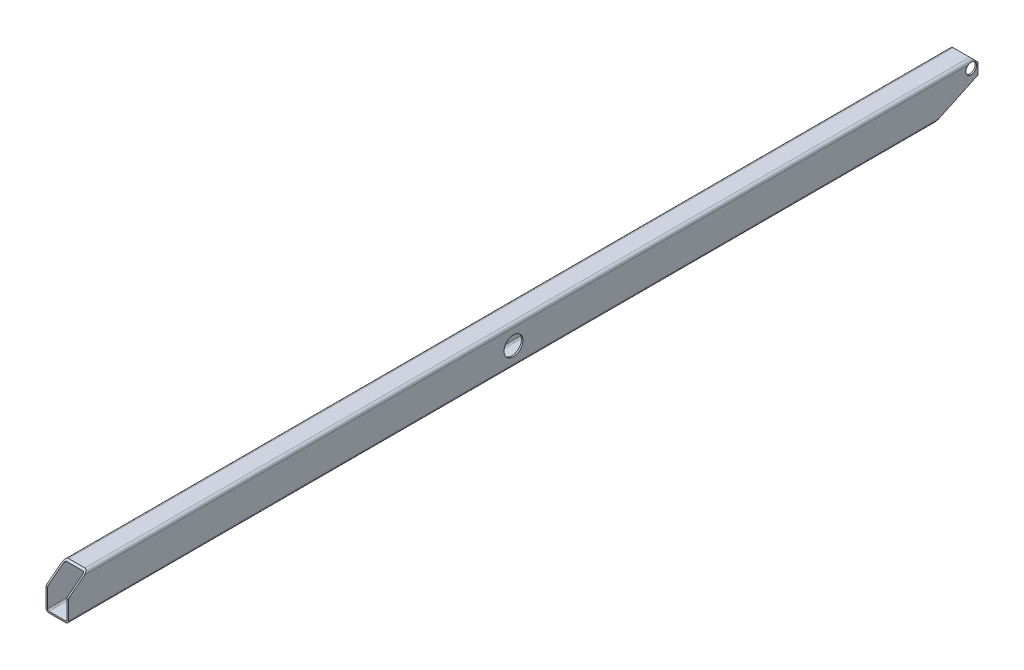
ISO-10303-21;
HEADER;
FILE_DESCRIPTION(('STEP AP214'),'2;1');
FILE_NAME('part.step','',(''),(''),'','','');
FILE_SCHEMA(('AUTOMOTIVE_DESIGN { 1 0 10303 214 1 1 1 1 }'));
ENDSEC;
DATA;
#1=APPLICATION_CONTEXT('core data for automotive mechanical design processes');
#2=APPLICATION_PROTOCOL_DEFINITION('international standard','automotive_design',2000,#1);
#3=PRODUCT_CONTEXT('',#1,'mechanical');
#4=PRODUCT('Part','Part','',(#3));
#5=PRODUCT_RELATED_PRODUCT_CATEGORY('part','',(#4));
#6=PRODUCT_DEFINITION_FORMATION('','',#4);
#7=PRODUCT_DEFINITION_CONTEXT('part definition',#1,'design');
#8=PRODUCT_DEFINITION('design','',#6,#7);
#9=PRODUCT_DEFINITION_SHAPE('','',#8);
#10=(LENGTH_UNIT() NAMED_UNIT(*) SI_UNIT(.MILLI.,.METRE.));
#11=(NAMED_UNIT(*) PLANE_ANGLE_UNIT() SI_UNIT($,.RADIAN.));
#12=(NAMED_UNIT(*) SI_UNIT($,.STERADIAN.) SOLID_ANGLE_UNIT());
#13=UNCERTAINTY_MEASURE_WITH_UNIT(LENGTH_MEASURE(1.E-05),#10,'distance_accuracy_value','');
#14=(GEOMETRIC_REPRESENTATION_CONTEXT(3) GLOBAL_UNCERTAINTY_ASSIGNED_CONTEXT((#13)) GLOBAL_UNIT_ASSIGNED_CONTEXT((#10,
#11,#12)) REPRESENTATION_CONTEXT('',''));
#15=CARTESIAN_POINT('',(0.,0.,0.));
#16=DIRECTION('',(0.,0.,1.));
#17=DIRECTION('',(1.,0.,0.));
#18=AXIS2_PLACEMENT_3D('',#15,#16,#17);
#19=CARTESIAN_POINT('',(20.0000000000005,20.,-3029.));
#20=DIRECTION('',(0.,0.,1.));
#21=DIRECTION('',(1.,0.,0.));
#22=AXIS2_PLACEMENT_3D('',#19,#20,#21);
#23=PLANE('',#22);
#24=DIRECTION('',(0.,1.,0.));
#25=VECTOR('',#24,1.);
#26=CARTESIAN_POINT('',(150.,20.,-3029.));
#27=LINE('',#26,#25);
#28=CARTESIAN_POINT('',(150.,140.,-3029.));
#29=VERTEX_POINT('',#28);
#30=CARTESIAN_POINT('',(150.,215.,-3029.));
#31=VERTEX_POINT('',#30);
#32=EDGE_CURVE('E244',#29,#31,#27,.T.);
#33=ORIENTED_EDGE('',*,*,#32,.F.);
#34=DIRECTION('',(1.,0.,0.));
#35=VECTOR('',#34,1.);
#36=CARTESIAN_POINT('',(0.,140.,-3029.));
#37=LINE('',#36,#35);
#38=CARTESIAN_POINT('',(140.,140.,-3029.));
#39=VERTEX_POINT('',#38);
#40=EDGE_CURVE('E226',#39,#29,#37,.T.);
#41=ORIENTED_EDGE('',*,*,#40,.F.);
#42=DIRECTION('',(0.,1.,0.));
#43=VECTOR('',#42,1.);
#44=CARTESIAN_POINT('',(140.,20.,-3029.));
#45=LINE('',#44,#43);
#46=CARTESIAN_POINT('',(140.,215.,-3029.));
#47=VERTEX_POINT('',#46);
#48=EDGE_CURVE('E370',#39,#47,#45,.T.);
#49=ORIENTED_EDGE('',*,*,#48,.T.);
#50=DIRECTION('',(1.,0.,0.));
#51=VECTOR('',#50,1.);
#52=CARTESIAN_POINT('',(20.0000000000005,215.,-3029.));
#53=LINE('',#52,#51);
#54=EDGE_CURVE('E284',#47,#31,#53,.T.);
#55=ORIENTED_EDGE('',*,*,#54,.T.);
#56=EDGE_LOOP('',(#33,#41,#49,#55));
#57=FACE_BOUND('',#56,.T.);
#58=ADVANCED_FACE('F32',(#57),#23,.F.);
#59=CARTESIAN_POINT('',(20.0000000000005,20.,3029.));
#60=DIRECTION('',(0.,0.,1.));
#61=DIRECTION('',(1.,0.,0.));
#62=AXIS2_PLACEMENT_3D('',#59,#60,#61);
#63=PLANE('',#62);
#64=DIRECTION('',(0.,-1.,0.));
#65=VECTOR('',#64,1.);
#66=CARTESIAN_POINT('',(10.0000000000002,230.,3029.));
#67=LINE('',#66,#65);
#68=CARTESIAN_POINT('',(10.0000000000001,140.15197005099,3029.));
#69=VERTEX_POINT('',#68);
#70=CARTESIAN_POINT('',(10.,20.,3029.));
#71=VERTEX_POINT('',#70);
#72=EDGE_CURVE('E358',#69,#71,#67,.T.);
#73=ORIENTED_EDGE('',*,*,#72,.F.);
#74=DIRECTION('',(-1.,0.,0.));
#75=VECTOR('',#74,1.);
#76=CARTESIAN_POINT('',(20.0000000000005,140.15197005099,3029.));
#77=LINE('',#76,#75);
#78=CARTESIAN_POINT('',(0.,140.15197005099,3029.));
#79=VERTEX_POINT('',#78);
#80=EDGE_CURVE('E343',#69,#79,#77,.T.);
#81=ORIENTED_EDGE('',*,*,#80,.T.);
#82=DIRECTION('',(0.,-1.,0.));
#83=VECTOR('',#82,1.);
#84=CARTESIAN_POINT('',(0.,230.,3029.));
#85=LINE('',#84,#83);
#86=CARTESIAN_POINT('',(0.,20.,3029.));
#87=VERTEX_POINT('',#86);
#88=EDGE_CURVE('E256',#79,#87,#85,.T.);
#89=ORIENTED_EDGE('',*,*,#88,.T.);
#90=CARTESIAN_POINT('',(20.0000000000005,20.,3029.));
#91=DIRECTION('',(0.,0.,1.));
#92=DIRECTION('',(1.,0.,0.));
#93=AXIS2_PLACEMENT_3D('',#90,#91,#92);
#94=CIRCLE('',#93,20.0000000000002);
#95=CARTESIAN_POINT('',(19.9999999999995,0.,3029.));
#96=VERTEX_POINT('',#95);
#97=EDGE_CURVE('E243',#87,#96,#94,.T.);
#98=ORIENTED_EDGE('',*,*,#97,.T.);
#99=DIRECTION('',(1.,0.,0.));
#100=VECTOR('',#99,1.);
#101=CARTESIAN_POINT('',(19.9999999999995,0.,3029.));
#102=LINE('',#101,#100);
#103=CARTESIAN_POINT('',(129.999999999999,0.,3029.));
#104=VERTEX_POINT('',#103);
#105=EDGE_CURVE('E247',#96,#104,#102,.T.);
#106=ORIENTED_EDGE('',*,*,#105,.T.);
#107=CARTESIAN_POINT('',(130.,20.,3029.));
#108=DIRECTION('',(0.,0.,1.));
#109=DIRECTION('',(1.,0.,0.));
#110=AXIS2_PLACEMENT_3D('',#107,#108,#109);
#111=CIRCLE('',#110,19.9999999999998);
#112=CARTESIAN_POINT('',(150.,20.,3029.));
#113=VERTEX_POINT('',#112);
#114=EDGE_CURVE('E719',#104,#113,#111,.T.);
#115=ORIENTED_EDGE('',*,*,#114,.T.);
#116=DIRECTION('',(0.,1.,0.));
#117=VECTOR('',#116,1.);
#118=CARTESIAN_POINT('',(150.,20.,3029.));
#119=LINE('',#118,#117);
#120=CARTESIAN_POINT('',(150.,140.15197005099,3029.));
#121=VERTEX_POINT('',#120);
#122=EDGE_CURVE('E716',#113,#121,#119,.T.);
#123=ORIENTED_EDGE('',*,*,#122,.T.);
#124=DIRECTION('',(-1.,0.,0.));
#125=VECTOR('',#124,1.);
#126=CARTESIAN_POINT('',(20.0000000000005,140.15197005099,3029.));
#127=LINE('',#126,#125);
#128=CARTESIAN_POINT('',(140.,140.15197005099,3029.));
#129=VERTEX_POINT('',#128);
#130=EDGE_CURVE('E340',#121,#129,#127,.T.);
#131=ORIENTED_EDGE('',*,*,#130,.T.);
#132=DIRECTION('',(0.,1.,0.));
#133=VECTOR('',#132,1.);
#134=CARTESIAN_POINT('',(140.,20.,3029.));
#135=LINE('',#134,#133);
#136=CARTESIAN_POINT('',(140.,20.,3029.));
#137=VERTEX_POINT('',#136);
#138=EDGE_CURVE('E748',#137,#129,#135,.T.);
#139=ORIENTED_EDGE('',*,*,#138,.F.);
#140=CARTESIAN_POINT('',(130.,20.,3029.));
#141=DIRECTION('',(0.,0.,1.));
#142=DIRECTION('',(1.,0.,0.));
#143=AXIS2_PLACEMENT_3D('',#140,#141,#142);
#144=CIRCLE('',#143,9.99999999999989);
#145=CARTESIAN_POINT('',(129.999999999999,10.,3029.));
#146=VERTEX_POINT('',#145);
#147=EDGE_CURVE('E750',#146,#137,#144,.T.);
#148=ORIENTED_EDGE('',*,*,#147,.F.);
#149=DIRECTION('',(1.,0.,0.));
#150=VECTOR('',#149,1.);
#151=CARTESIAN_POINT('',(20.,9.99999999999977,3029.));
#152=LINE('',#151,#150);
#153=CARTESIAN_POINT('',(20.,9.99999999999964,3029.));
#154=VERTEX_POINT('',#153);
#155=EDGE_CURVE('E753',#154,#146,#152,.T.);
#156=ORIENTED_EDGE('',*,*,#155,.F.);
#157=CARTESIAN_POINT('',(20.0000000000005,20.,3029.));
#158=DIRECTION('',(0.,0.,1.));
#159=DIRECTION('',(1.,0.,0.));
#160=AXIS2_PLACEMENT_3D('',#157,#158,#159);
#161=CIRCLE('',#160,10.0000000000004);
#162=EDGE_CURVE('E369',#71,#154,#161,.T.);
#163=ORIENTED_EDGE('',*,*,#162,.F.);
#164=EDGE_LOOP('',(#73,#81,#89,#98,#106,#115,#123,#131,#139,#148,#156,#163));
#165=FACE_BOUND('',#164,.T.);
#166=ADVANCED_FACE('F367',(#165),#63,.T.);
#167=DIRECTION('',(0.,-1.,0.));
#168=VECTOR('',#167,1.);
#169=CARTESIAN_POINT('',(10.0000000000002,230.,-3029.));
#170=LINE('',#169,#168);
#171=CARTESIAN_POINT('',(10.0000000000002,214.999999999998,-3029.));
#172=VERTEX_POINT('',#171);
#173=CARTESIAN_POINT('',(10.0000000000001,140.,-3029.));
#174=VERTEX_POINT('',#173);
#175=EDGE_CURVE('E236',#172,#174,#170,.T.);
#176=ORIENTED_EDGE('',*,*,#175,.T.);
#177=CARTESIAN_POINT('',(0.,140.,-3029.));
#178=VERTEX_POINT('',#177);
#179=EDGE_CURVE('E218',#178,#174,#37,.T.);
#180=ORIENTED_EDGE('',*,*,#179,.F.);
#181=DIRECTION('',(0.,-1.,0.));
#182=VECTOR('',#181,1.);
#183=CARTESIAN_POINT('',(0.,230.,-3029.));
#184=LINE('',#183,#182);
#185=CARTESIAN_POINT('',(0.,215.,-3029.));
#186=VERTEX_POINT('',#185);
#187=EDGE_CURVE('E233',#186,#178,#184,.T.);
#188=ORIENTED_EDGE('',*,*,#187,.F.);
#189=DIRECTION('',(1.,0.,0.));
#190=VECTOR('',#189,1.);
#191=CARTESIAN_POINT('',(20.0000000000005,215.,-3029.));
#192=LINE('',#191,#190);
#193=EDGE_CURVE('E287',#186,#172,#192,.T.);
#194=ORIENTED_EDGE('',*,*,#193,.T.);
#195=EDGE_LOOP('',(#176,#180,#188,#194));
#196=FACE_BOUND('',#195,.T.);
#197=ADVANCED_FACE('F232',(#196),#23,.F.);
#198=CARTESIAN_POINT('',(20.0000000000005,20.,3029.));
#199=DIRECTION('',(0.,0.,-1.));
#200=DIRECTION('',(-1.,0.,0.));
#201=AXIS2_PLACEMENT_3D('',#198,#199,#200);
#202=CYLINDRICAL_SURFACE('',#201,20.0000000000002);
#203=DIRECTION('',(0.,0.,-1.));
#204=VECTOR('',#203,1.);
#205=CARTESIAN_POINT('',(0.,20.,3029.));
#206=LINE('',#205,#204);
#207=CARTESIAN_POINT('',(0.,19.9999999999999,-2771.85714285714));
#208=VERTEX_POINT('',#207);
#209=EDGE_CURVE('E253',#87,#208,#206,.T.);
#210=ORIENTED_EDGE('',*,*,#209,.T.);
#211=CARTESIAN_POINT('',(20.0000000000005,20.,-2771.85714285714));
#212=DIRECTION('',(0.,0.906183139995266,0.422885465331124));
#213=DIRECTION('',(0.,0.422885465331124,-0.906183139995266));
#214=AXIS2_PLACEMENT_3D('',#211,#212,#213);
#215=ELLIPSE('',#214,47.2941295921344,20.0000000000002);
#216=CARTESIAN_POINT('',(19.9999999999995,0.,-2729.));
#217=VERTEX_POINT('',#216);
#218=EDGE_CURVE('E221',#208,#217,#215,.T.);
#219=ORIENTED_EDGE('',*,*,#218,.T.);
#220=DIRECTION('',(0.,0.,-1.));
#221=VECTOR('',#220,1.);
#222=CARTESIAN_POINT('',(19.9999999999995,0.,3029.));
#223=LINE('',#222,#221);
#224=EDGE_CURVE('E274',#96,#217,#223,.T.);
#225=ORIENTED_EDGE('',*,*,#224,.F.);
#226=ORIENTED_EDGE('',*,*,#97,.F.);
#227=EDGE_LOOP('',(#210,#219,#225,#226));
#228=FACE_BOUND('',#227,.T.);
#229=ADVANCED_FACE('F468',(#228),#202,.T.);
#230=CARTESIAN_POINT('',(19.9999999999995,0.,3029.));
#231=DIRECTION('',(0.,1.,0.));
#232=DIRECTION('',(0.,0.,1.));
#233=AXIS2_PLACEMENT_3D('',#230,#231,#232);
#234=PLANE('',#233);
#235=ORIENTED_EDGE('',*,*,#224,.T.);
#236=DIRECTION('',(1.,0.,0.));
#237=VECTOR('',#236,1.);
#238=CARTESIAN_POINT('',(0.,0.,-2729.));
#239=LINE('',#238,#237);
#240=CARTESIAN_POINT('',(130.,2.0122792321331E-13,-2729.));
#241=VERTEX_POINT('',#240);
#242=EDGE_CURVE('E237',#217,#241,#239,.T.);
#243=ORIENTED_EDGE('',*,*,#242,.T.);
#244=DIRECTION('',(0.,0.,-1.));
#245=VECTOR('',#244,1.);
#246=CARTESIAN_POINT('',(129.999999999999,0.,3029.));
#247=LINE('',#246,#245);
#248=EDGE_CURVE('E271',#104,#241,#247,.T.);
#249=ORIENTED_EDGE('',*,*,#248,.F.);
#250=ORIENTED_EDGE('',*,*,#105,.F.);
#251=EDGE_LOOP('',(#235,#243,#249,#250));
#252=FACE_BOUND('',#251,.T.);
#253=ADVANCED_FACE('F464',(#252),#234,.F.);
#254=CARTESIAN_POINT('',(130.,20.,3029.));
#255=DIRECTION('',(0.,0.,-1.));
#256=DIRECTION('',(-1.,0.,0.));
#257=AXIS2_PLACEMENT_3D('',#254,#255,#256);
#258=CYLINDRICAL_SURFACE('',#257,19.9999999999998);
#259=ORIENTED_EDGE('',*,*,#248,.T.);
#260=CARTESIAN_POINT('',(130.,20.,-2771.85714285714));
#261=DIRECTION('',(0.,0.906183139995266,0.422885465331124));
#262=DIRECTION('',(0.,0.422885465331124,-0.906183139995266));
#263=AXIS2_PLACEMENT_3D('',#260,#261,#262);
#264=ELLIPSE('',#263,47.2941295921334,19.9999999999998);
#265=CARTESIAN_POINT('',(150.,19.9999999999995,-2771.85714285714));
#266=VERTEX_POINT('',#265);
#267=EDGE_CURVE('E695',#241,#266,#264,.T.);
#268=ORIENTED_EDGE('',*,*,#267,.T.);
#269=DIRECTION('',(0.,0.,-1.));
#270=VECTOR('',#269,1.);
#271=CARTESIAN_POINT('',(150.,20.,3029.));
#272=LINE('',#271,#270);
#273=EDGE_CURVE('E268',#113,#266,#272,.T.);
#274=ORIENTED_EDGE('',*,*,#273,.F.);
#275=ORIENTED_EDGE('',*,*,#114,.F.);
#276=EDGE_LOOP('',(#259,#268,#274,#275));
#277=FACE_BOUND('',#276,.T.);
#278=ADVANCED_FACE('F460',(#277),#258,.T.);
#279=CARTESIAN_POINT('',(150.,20.,3029.));
#280=DIRECTION('',(-1.,0.,0.));
#281=DIRECTION('',(0.,0.,1.));
#282=AXIS2_PLACEMENT_3D('',#279,#280,#281);
#283=PLANE('',#282);
#284=CARTESIAN_POINT('',(150.000000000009,124.999999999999,65.0777294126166));
#285=DIRECTION('',(1.,0.,0.));
#286=DIRECTION('',(0.,1.,0.));
#287=AXIS2_PLACEMENT_3D('',#284,#285,#286);
#288=CIRCLE('',#287,63.);
#289=CARTESIAN_POINT('',(150.000000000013,187.999999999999,65.0777294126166));
#290=VERTEX_POINT('',#289);
#291=EDGE_CURVE('E689',#290,#290,#288,.T.);
#292=ORIENTED_EDGE('',*,*,#291,.F.);
#293=EDGE_LOOP('',(#292));
#294=FACE_BOUND('',#293,.T.);
#295=DIRECTION('',(0.,-0.609710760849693,0.7926239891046));
#296=VECTOR('',#295,1.);
#297=CARTESIAN_POINT('',(150.,150.,3029.));
#298=LINE('',#297,#296);
#299=CARTESIAN_POINT('',(150.,230.,2925.));
#300=VERTEX_POINT('',#299);
#301=CARTESIAN_POINT('',(150.,156.004449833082,3021.19421521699));
#302=VERTEX_POINT('',#301);
#303=EDGE_CURVE('E329',#300,#302,#298,.T.);
#304=ORIENTED_EDGE('',*,*,#303,.T.);
#305=CARTESIAN_POINT('',(150.,140.15197005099,3009.));
#306=DIRECTION('',(-1.,0.,0.));
#307=DIRECTION('',(0.,0.,1.));
#308=AXIS2_PLACEMENT_3D('',#305,#306,#307);
#309=CIRCLE('',#308,20.);
#310=EDGE_CURVE('E12',#302,#121,#309,.F.);
#311=ORIENTED_EDGE('',*,*,#310,.T.);
#312=ORIENTED_EDGE('',*,*,#122,.F.);
#313=ORIENTED_EDGE('',*,*,#273,.T.);
#314=DIRECTION('',(0.,-0.422885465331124,0.906183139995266));
#315=VECTOR('',#314,1.);
#316=CARTESIAN_POINT('',(150.,140.,-3029.));
#317=LINE('',#316,#315);
#318=EDGE_CURVE('E227',#29,#266,#317,.T.);
#319=ORIENTED_EDGE('',*,*,#318,.F.);
#320=ORIENTED_EDGE('',*,*,#32,.T.);
#321=DIRECTION('',(0.,-0.707106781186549,-0.707106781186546));
#322=VECTOR('',#321,1.);
#323=CARTESIAN_POINT('',(150.,250.,-2994.));
#324=LINE('',#323,#322);
#325=CARTESIAN_POINT('',(150.,230.,-3014.));
#326=VERTEX_POINT('',#325);
#327=EDGE_CURVE('E304',#31,#326,#324,.F.);
#328=ORIENTED_EDGE('',*,*,#327,.T.);
#329=DIRECTION('',(0.,0.,-1.));
#330=VECTOR('',#329,1.);
#331=CARTESIAN_POINT('',(150.,230.,3029.));
#332=LINE('',#331,#330);
#333=CARTESIAN_POINT('',(150.,230.,-3002.9802528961));
#334=VERTEX_POINT('',#333);
#335=EDGE_CURVE('E264',#334,#326,#332,.T.);
#336=ORIENTED_EDGE('',*,*,#335,.F.);
#337=CARTESIAN_POINT('',(150.000000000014,199.999999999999,-2984.));
#338=DIRECTION('',(1.,0.,0.));
#339=DIRECTION('',(0.,1.,0.));
#340=AXIS2_PLACEMENT_3D('',#337,#338,#339);
#341=CIRCLE('',#340,35.4999999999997);
#342=CARTESIAN_POINT('',(150.000000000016,229.999999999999,-2965.0197471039));
#343=VERTEX_POINT('',#342);
#344=EDGE_CURVE('E399',#343,#334,#341,.T.);
#345=ORIENTED_EDGE('',*,*,#344,.F.);
#346=EDGE_CURVE('E265',#300,#343,#332,.T.);
#347=ORIENTED_EDGE('',*,*,#346,.F.);
#348=EDGE_LOOP('',(#304,#311,#312,#313,#319,#320,#328,#336,#345,#347));
#349=FACE_BOUND('',#348,.T.);
#350=ADVANCED_FACE('F456',(#294,#349),#283,.F.);
#351=CARTESIAN_POINT('',(130.,230.,3029.));
#352=DIRECTION('',(0.,0.,-1.));
#353=DIRECTION('',(-1.,0.,0.));
#354=AXIS2_PLACEMENT_3D('',#351,#352,#353);
#355=CYLINDRICAL_SURFACE('',#354,20.);
#356=ORIENTED_EDGE('',*,*,#346,.T.);
#357=CARTESIAN_POINT('',(150.,230.,-2965.0197471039));
#358=CARTESIAN_POINT('',(149.999990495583,230.225989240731,-2965.37693450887));
#359=CARTESIAN_POINT('',(149.99616964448,230.445578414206,-2965.73814262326));
#360=CARTESIAN_POINT('',(149.982135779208,230.871651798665,-2966.46804116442));
#361=CARTESIAN_POINT('',(149.971923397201,231.078137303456,-2966.83673084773));
#362=CARTESIAN_POINT('',(149.946342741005,231.477646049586,-2967.58092305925));
#363=CARTESIAN_POINT('',(149.930976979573,231.670675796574,-2967.95642218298));
#364=CARTESIAN_POINT('',(149.896243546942,232.043150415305,-2968.71390578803));
#365=CARTESIAN_POINT('',(149.876875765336,232.222594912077,-2969.095890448));
#366=CARTESIAN_POINT('',(149.814376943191,232.740773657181,-2970.25206565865));
#367=CARTESIAN_POINT('',(149.766893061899,233.058785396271,-2971.03541956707));
#368=CARTESIAN_POINT('',(149.668517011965,233.638111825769,-2972.62276659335));
#369=CARTESIAN_POINT('',(149.617624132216,233.899414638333,-2973.42676399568));
#370=CARTESIAN_POINT('',(149.540295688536,234.265610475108,-2974.70725225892));
#371=CARTESIAN_POINT('',(149.512632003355,234.389871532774,-2975.17820928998));
#372=CARTESIAN_POINT('',(149.45968343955,234.618936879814,-2976.1249538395));
#373=CARTESIAN_POINT('',(149.434398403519,234.723742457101,-2976.60074103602));
#374=CARTESIAN_POINT('',(149.387236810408,234.913717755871,-2977.55642200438));
#375=CARTESIAN_POINT('',(149.365360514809,234.998885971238,-2978.03631608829));
#376=CARTESIAN_POINT('',(149.325878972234,235.149413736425,-2978.99937599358));
#377=CARTESIAN_POINT('',(149.308273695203,235.214773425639,-2979.48254179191));
#378=CARTESIAN_POINT('',(149.278025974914,235.325505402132,-2980.45091848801));
#379=CARTESIAN_POINT('',(149.265379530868,235.370893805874,-2980.93612741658));
#380=CARTESIAN_POINT('',(149.245510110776,235.441662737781,-2981.90811504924));
#381=CARTESIAN_POINT('',(149.238287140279,235.467043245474,-2982.39489375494));
#382=CARTESIAN_POINT('',(149.229537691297,235.497739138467,-2983.36911402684));
#383=CARTESIAN_POINT('',(149.228010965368,235.503055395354,-2983.85655556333));
#384=CARTESIAN_POINT('',(149.230710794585,235.493613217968,-2984.83122769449));
#385=CARTESIAN_POINT('',(149.234937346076,235.478854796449,-2985.31845828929));
#386=CARTESIAN_POINT('',(149.24898690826,235.42928775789,-2986.29198760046));
#387=CARTESIAN_POINT('',(149.258811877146,235.394472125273,-2986.77828593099));
#388=CARTESIAN_POINT('',(149.283687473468,235.304861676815,-2987.74890335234));
#389=CARTESIAN_POINT('',(149.298738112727,235.250066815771,-2988.23322243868));
#390=CARTESIAN_POINT('',(149.333491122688,235.120606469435,-2989.19908064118));
#391=CARTESIAN_POINT('',(149.353193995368,235.045938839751,-2989.68061945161));
#392=CARTESIAN_POINT('',(149.396484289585,234.876884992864,-2990.64004235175));
#393=CARTESIAN_POINT('',(149.420071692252,234.782498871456,-2991.11792645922));
#394=CARTESIAN_POINT('',(149.470193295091,234.574171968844,-2992.06931193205));
#395=CARTESIAN_POINT('',(149.496727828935,234.460228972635,-2992.54281279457));
#396=CARTESIAN_POINT('',(149.551645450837,234.212979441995,-2993.48467860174));
#397=CARTESIAN_POINT('',(149.580028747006,234.079670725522,-2993.95304296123));
#398=CARTESIAN_POINT('',(149.637389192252,233.793964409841,-2994.88369511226));
#399=CARTESIAN_POINT('',(149.666366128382,233.641573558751,-2995.34598498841));
#400=CARTESIAN_POINT('',(149.723553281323,233.317898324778,-2996.26395201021));
#401=CARTESIAN_POINT('',(149.751763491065,233.146613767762,-2996.71962909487));
#402=CARTESIAN_POINT('',(149.809140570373,232.763998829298,-2997.67723564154));
#403=CARTESIAN_POINT('',(149.838024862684,232.550328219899,-2998.17824936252));
#404=CARTESIAN_POINT('',(149.890722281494,232.100118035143,-2999.17000099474));
#405=CARTESIAN_POINT('',(149.914536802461,231.863584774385,-2999.66074169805));
#406=CARTESIAN_POINT('',(149.95466410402,231.368569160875,-3000.6300419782));
#407=CARTESIAN_POINT('',(149.970992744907,231.110134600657,-3001.10862526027));
#408=CARTESIAN_POINT('',(149.993649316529,230.571348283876,-3002.05377894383));
#409=CARTESIAN_POINT('',(149.999973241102,230.290987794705,-3002.52034445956));
#410=CARTESIAN_POINT('',(150.,230.,-3002.9802528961));
#411=B_SPLINE_CURVE_WITH_KNOTS('',3,(#357,#358,#359,#360,#361,#362,#363,#364,#365,#366,#367,
#368,#369,#370,#371,#372,#373,#374,#375,#376,#377,#378,#379,#380,#381,#382,#383,#384,#385,#386,
#387,#388,#389,#390,#391,#392,#393,#394,#395,#396,#397,#398,#399,#400,#401,#402,#403,#404,#405,
#406,#407,#408,#409,#410),.UNSPECIFIED.,.F.,.F.,(4,2,2,2,2,2,2,2,2,2,2,2,2,2,2,2,2,2,2,2,2,2,2,
2,2,2,4),(0.,1.26790395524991,2.53568252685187,3.80284383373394,5.07004010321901,
7.60802803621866,10.1465470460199,11.6097583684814,13.0728727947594,14.5360993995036,
15.9993157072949,17.4613490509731,18.9233838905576,20.3853552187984,21.8473256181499,
23.3098076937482,24.772293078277,26.2349363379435,27.6975724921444,29.1603744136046,
30.6233412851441,32.0857922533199,33.5482567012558,35.1839738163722,36.8192404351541,
38.4510262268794,40.0834652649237),.UNSPECIFIED.);
#412=EDGE_CURVE('E441',#343,#334,#411,.T.);
#413=ORIENTED_EDGE('',*,*,#412,.T.);
#414=ORIENTED_EDGE('',*,*,#335,.T.);
#415=CARTESIAN_POINT('',(130.,230.,-3014.));
#416=DIRECTION('',(0.,-0.707106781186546,0.707106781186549));
#417=DIRECTION('',(0.,-0.707106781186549,-0.707106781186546));
#418=AXIS2_PLACEMENT_3D('',#415,#416,#417);
#419=ELLIPSE('',#418,28.2842712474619,20.);
#420=CARTESIAN_POINT('',(129.999999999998,250.,-2994.));
#421=VERTEX_POINT('',#420);
#422=EDGE_CURVE('E307',#326,#421,#419,.T.);
#423=ORIENTED_EDGE('',*,*,#422,.T.);
#424=DIRECTION('',(0.,0.,-1.));
#425=VECTOR('',#424,1.);
#426=CARTESIAN_POINT('',(129.999999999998,250.,3029.));
#427=LINE('',#426,#425);
#428=CARTESIAN_POINT('',(129.999999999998,250.,2899.));
#429=VERTEX_POINT('',#428);
#430=EDGE_CURVE('E262',#429,#421,#427,.T.);
#431=ORIENTED_EDGE('',*,*,#430,.F.);
#432=CARTESIAN_POINT('',(130.,230.,2925.));
#433=DIRECTION('',(0.,0.7926239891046,0.609710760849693));
#434=DIRECTION('',(0.,0.609710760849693,-0.7926239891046));
#435=AXIS2_PLACEMENT_3D('',#432,#433,#434);
#436=ELLIPSE('',#435,32.8024389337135,20.);
#437=EDGE_CURVE('E327',#429,#300,#436,.F.);
#438=ORIENTED_EDGE('',*,*,#437,.T.);
#439=EDGE_LOOP('',(#356,#413,#414,#423,#431,#438));
#440=FACE_BOUND('',#439,.T.);
#441=ADVANCED_FACE('F452',(#440),#355,.T.);
#442=CARTESIAN_POINT('',(129.999999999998,250.,3029.));
#443=DIRECTION('',(0.,-1.,0.));
#444=DIRECTION('',(0.,0.,-1.));
#445=AXIS2_PLACEMENT_3D('',#442,#443,#444);
#446=PLANE('',#445);
#447=DIRECTION('',(0.,0.,-1.));
#448=VECTOR('',#447,1.);
#449=CARTESIAN_POINT('',(19.9999999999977,250.,3029.));
#450=LINE('',#449,#448);
#451=CARTESIAN_POINT('',(19.9999999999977,250.,2899.));
#452=VERTEX_POINT('',#451);
#453=CARTESIAN_POINT('',(19.9999999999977,250.,-2994.));
#454=VERTEX_POINT('',#453);
#455=EDGE_CURVE('E260',#452,#454,#450,.T.);
#456=ORIENTED_EDGE('',*,*,#455,.F.);
#457=DIRECTION('',(1.,0.,0.));
#458=VECTOR('',#457,1.);
#459=CARTESIAN_POINT('',(129.999999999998,250.,2899.));
#460=LINE('',#459,#458);
#461=EDGE_CURVE('E325',#452,#429,#460,.T.);
#462=ORIENTED_EDGE('',*,*,#461,.T.);
#463=ORIENTED_EDGE('',*,*,#430,.T.);
#464=DIRECTION('',(-1.,0.,0.));
#465=VECTOR('',#464,1.);
#466=CARTESIAN_POINT('',(129.999999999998,250.,-2994.));
#467=LINE('',#466,#465);
#468=EDGE_CURVE('E277',#421,#454,#467,.T.);
#469=ORIENTED_EDGE('',*,*,#468,.T.);
#470=EDGE_LOOP('',(#456,#462,#463,#469));
#471=FACE_BOUND('',#470,.T.);
#472=ADVANCED_FACE('F386',(#471),#446,.F.);
#473=CARTESIAN_POINT('',(20.0000000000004,230.,3029.));
#474=DIRECTION('',(0.,0.,-1.));
#475=DIRECTION('',(-1.,0.,0.));
#476=AXIS2_PLACEMENT_3D('',#473,#474,#475);
#477=CYLINDRICAL_SURFACE('',#476,20.0000000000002);
#478=DIRECTION('',(0.,0.,-1.));
#479=VECTOR('',#478,1.);
#480=CARTESIAN_POINT('',(2.08166817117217E-13,230.,3029.));
#481=LINE('',#480,#479);
#482=CARTESIAN_POINT('',(0.,230.,-3002.98025289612));
#483=VERTEX_POINT('',#482);
#484=CARTESIAN_POINT('',(1.05239890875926E-13,230.000000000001,-3014.));
#485=VERTEX_POINT('',#484);
#486=EDGE_CURVE('E255',#483,#485,#481,.T.);
#487=ORIENTED_EDGE('',*,*,#486,.F.);
#488=CARTESIAN_POINT('',(2.08166817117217E-13,230.,-3002.98025289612));
#489=CARTESIAN_POINT('',(9.50441735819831E-06,230.225989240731,-3002.62306549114));
#490=CARTESIAN_POINT('',(0.00383035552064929,230.445578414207,-3002.26185737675));
#491=CARTESIAN_POINT('',(0.0178642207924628,230.871651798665,-3001.53195883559));
#492=CARTESIAN_POINT('',(0.0280766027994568,231.078137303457,-3001.16326915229));
#493=CARTESIAN_POINT('',(0.0536572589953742,231.477646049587,-3000.41907694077));
#494=CARTESIAN_POINT('',(0.0690230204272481,231.670675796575,-3000.04357781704));
#495=CARTESIAN_POINT('',(0.103756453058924,232.043150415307,-2999.28609421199));
#496=CARTESIAN_POINT('',(0.123124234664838,232.222594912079,-2998.90410955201));
#497=CARTESIAN_POINT('',(0.18562305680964,232.740773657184,-2997.74793434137));
#498=CARTESIAN_POINT('',(0.233106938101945,233.058785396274,-2996.96458043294));
#499=CARTESIAN_POINT('',(0.331482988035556,233.638111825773,-2995.37723340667));
#500=CARTESIAN_POINT('',(0.382375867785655,233.899414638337,-2994.57323600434));
#501=CARTESIAN_POINT('',(0.459704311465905,234.265610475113,-2993.2927477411));
#502=CARTESIAN_POINT('',(0.487367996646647,234.38987153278,-2992.82179071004));
#503=CARTESIAN_POINT('',(0.540316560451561,234.61893687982,-2991.87504616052));
#504=CARTESIAN_POINT('',(0.565601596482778,234.723742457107,-2991.399258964));
#505=CARTESIAN_POINT('',(0.612763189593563,234.913717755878,-2990.44357799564));
#506=CARTESIAN_POINT('',(0.63463948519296,234.998885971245,-2989.96368391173));
#507=CARTESIAN_POINT('',(0.674121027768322,235.149413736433,-2989.00062400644));
#508=CARTESIAN_POINT('',(0.691726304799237,235.214773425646,-2988.51745820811));
#509=CARTESIAN_POINT('',(0.721974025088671,235.32550540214,-2987.54908151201));
#510=CARTESIAN_POINT('',(0.734620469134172,235.370893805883,-2987.06387258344));
#511=CARTESIAN_POINT('',(0.754489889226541,235.44166273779,-2986.09188495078));
#512=CARTESIAN_POINT('',(0.761712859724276,235.467043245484,-2985.60510624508));
#513=CARTESIAN_POINT('',(0.770462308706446,235.497739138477,-2984.63088597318));
#514=CARTESIAN_POINT('',(0.771989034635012,235.503055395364,-2984.14344443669));
#515=CARTESIAN_POINT('',(0.769289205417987,235.493613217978,-2983.16877230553));
#516=CARTESIAN_POINT('',(0.765062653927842,235.47885479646,-2982.68154171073));
#517=CARTESIAN_POINT('',(0.751013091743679,235.429287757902,-2981.70801239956));
#518=CARTESIAN_POINT('',(0.74118812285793,235.394472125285,-2981.22171406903));
#519=CARTESIAN_POINT('',(0.716312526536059,235.304861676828,-2980.25109664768));
#520=CARTESIAN_POINT('',(0.701261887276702,235.250066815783,-2979.76677756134));
#521=CARTESIAN_POINT('',(0.666508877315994,235.120606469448,-2978.80091935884));
#522=CARTESIAN_POINT('',(0.646806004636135,235.045938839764,-2978.31938054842));
#523=CARTESIAN_POINT('',(0.603515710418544,234.876884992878,-2977.35995764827));
#524=CARTESIAN_POINT('',(0.579928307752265,234.78249887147,-2976.8820735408));
#525=CARTESIAN_POINT('',(0.529806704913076,234.57417196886,-2975.93068806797));
#526=CARTESIAN_POINT('',(0.503272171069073,234.46022897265,-2975.45718720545));
#527=CARTESIAN_POINT('',(0.44835454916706,234.212979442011,-2974.51532139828));
#528=CARTESIAN_POINT('',(0.419971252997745,234.079670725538,-2974.04695703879));
#529=CARTESIAN_POINT('',(0.362610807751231,233.793964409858,-2973.11630488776));
#530=CARTESIAN_POINT('',(0.333633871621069,233.641573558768,-2972.65401501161));
#531=CARTESIAN_POINT('',(0.276446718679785,233.317898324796,-2971.73604798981));
#532=CARTESIAN_POINT('',(0.248236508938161,233.14661376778,-2971.28037090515));
#533=CARTESIAN_POINT('',(0.190859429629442,232.763998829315,-2970.32276435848));
#534=CARTESIAN_POINT('',(0.161975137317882,232.550328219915,-2969.82175063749));
#535=CARTESIAN_POINT('',(0.109277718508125,232.100118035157,-2968.82999900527));
#536=CARTESIAN_POINT('',(0.085463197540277,231.863584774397,-2968.33925830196));
#537=CARTESIAN_POINT('',(0.0453358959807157,231.368569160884,-2967.3699580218));
#538=CARTESIAN_POINT('',(0.0290072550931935,231.110134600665,-2966.89137473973));
#539=CARTESIAN_POINT('',(0.00635068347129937,230.57134828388,-2965.94622105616));
#540=CARTESIAN_POINT('',(2.67588983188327E-05,230.290987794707,-2965.47965554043));
#541=CARTESIAN_POINT('',(2.06472280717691E-13,230.,-2965.01974710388));
#542=B_SPLINE_CURVE_WITH_KNOTS('',3,(#488,#489,#490,#491,#492,#493,#494,#495,#496,#497,#498,
#499,#500,#501,#502,#503,#504,#505,#506,#507,#508,#509,#510,#511,#512,#513,#514,#515,#516,#517,
#518,#519,#520,#521,#522,#523,#524,#525,#526,#527,#528,#529,#530,#531,#532,#533,#534,#535,#536,
#537,#538,#539,#540,#541),.UNSPECIFIED.,.F.,.F.,(4,2,2,2,2,2,2,2,2,2,2,2,2,2,2,2,2,2,2,2,2,2,2,
2,2,2,4),(0.,1.26790395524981,2.53568252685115,3.80284383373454,5.07004010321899,
7.60802803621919,10.1465470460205,11.6097583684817,13.0728727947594,14.5360993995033,
15.9993157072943,17.4613490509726,18.9233838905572,20.3853552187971,21.8473256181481,
23.3098076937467,24.7722930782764,26.2349363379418,27.6975724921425,29.1603744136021,
30.6233412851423,32.0857922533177,33.5482567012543,35.183973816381,36.8192404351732,
38.4510262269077,40.0834652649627),.UNSPECIFIED.);
#543=CARTESIAN_POINT('',(0.,230.,-2965.01974710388));
#544=VERTEX_POINT('',#543);
#545=EDGE_CURVE('E394',#483,#544,#542,.T.);
#546=ORIENTED_EDGE('',*,*,#545,.T.);
#547=CARTESIAN_POINT('',(2.08166817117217E-13,230.,2925.));
#548=VERTEX_POINT('',#547);
#549=EDGE_CURVE('E257',#548,#544,#481,.T.);
#550=ORIENTED_EDGE('',*,*,#549,.F.);
#551=CARTESIAN_POINT('',(20.0000000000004,230.,2925.));
#552=DIRECTION('',(0.,0.7926239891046,0.609710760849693));
#553=DIRECTION('',(0.,0.609710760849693,-0.7926239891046));
#554=AXIS2_PLACEMENT_3D('',#551,#552,#553);
#555=ELLIPSE('',#554,32.8024389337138,20.0000000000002);
#556=EDGE_CURVE('E323',#548,#452,#555,.F.);
#557=ORIENTED_EDGE('',*,*,#556,.T.);
#558=ORIENTED_EDGE('',*,*,#455,.T.);
#559=CARTESIAN_POINT('',(20.0000000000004,230.,-3014.));
#560=DIRECTION('',(0.,-0.707106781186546,0.707106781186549));
#561=DIRECTION('',(0.,-0.707106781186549,-0.707106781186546));
#562=AXIS2_PLACEMENT_3D('',#559,#560,#561);
#563=ELLIPSE('',#562,28.2842712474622,20.0000000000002);
#564=EDGE_CURVE('E280',#454,#485,#563,.T.);
#565=ORIENTED_EDGE('',*,*,#564,.T.);
#566=EDGE_LOOP('',(#487,#546,#550,#557,#558,#565));
#567=FACE_BOUND('',#566,.T.);
#568=ADVANCED_FACE('F382',(#567),#477,.T.);
#569=CARTESIAN_POINT('',(0.,230.,3029.));
#570=DIRECTION('',(1.,0.,0.));
#571=DIRECTION('',(0.,1.,0.));
#572=AXIS2_PLACEMENT_3D('',#569,#570,#571);
#573=PLANE('',#572);
#574=CARTESIAN_POINT('',(0.,125.000000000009,65.0777294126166));
#575=DIRECTION('',(1.,0.,0.));
#576=DIRECTION('',(0.,1.,0.));
#577=AXIS2_PLACEMENT_3D('',#574,#575,#576);
#578=CIRCLE('',#577,63.);
#579=CARTESIAN_POINT('',(0.,188.000000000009,65.0777294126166));
#580=VERTEX_POINT('',#579);
#581=EDGE_CURVE('E338',#580,#580,#578,.F.);
#582=ORIENTED_EDGE('',*,*,#581,.F.);
#583=EDGE_LOOP('',(#582));
#584=FACE_BOUND('',#583,.T.);
#585=ORIENTED_EDGE('',*,*,#88,.F.);
#586=CARTESIAN_POINT('',(0.,140.15197005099,3009.));
#587=DIRECTION('',(1.,0.,0.));
#588=DIRECTION('',(0.,1.,0.));
#589=AXIS2_PLACEMENT_3D('',#586,#587,#588);
#590=CIRCLE('',#589,20.);
#591=CARTESIAN_POINT('',(0.,156.004449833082,3021.19421521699));
#592=VERTEX_POINT('',#591);
#593=EDGE_CURVE('E346',#79,#592,#590,.F.);
#594=ORIENTED_EDGE('',*,*,#593,.T.);
#595=DIRECTION('',(0.,0.609710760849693,-0.7926239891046));
#596=VECTOR('',#595,1.);
#597=CARTESIAN_POINT('',(0.,150.,3029.));
#598=LINE('',#597,#596);
#599=EDGE_CURVE('E321',#592,#548,#598,.T.);
#600=ORIENTED_EDGE('',*,*,#599,.T.);
#601=ORIENTED_EDGE('',*,*,#549,.T.);
#602=CARTESIAN_POINT('',(0.,200.000000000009,-2984.));
#603=DIRECTION('',(1.,0.,0.));
#604=DIRECTION('',(0.,1.,0.));
#605=AXIS2_PLACEMENT_3D('',#602,#603,#604);
#606=CIRCLE('',#605,35.4999999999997);
#607=EDGE_CURVE('E396',#483,#544,#606,.F.);
#608=ORIENTED_EDGE('',*,*,#607,.F.);
#609=ORIENTED_EDGE('',*,*,#486,.T.);
#610=DIRECTION('',(0.,0.707106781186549,0.707106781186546));
#611=VECTOR('',#610,1.);
#612=CARTESIAN_POINT('',(0.,250.,-2994.));
#613=LINE('',#612,#611);
#614=EDGE_CURVE('E242',#485,#186,#613,.F.);
#615=ORIENTED_EDGE('',*,*,#614,.T.);
#616=ORIENTED_EDGE('',*,*,#187,.T.);
#617=DIRECTION('',(0.,-0.422885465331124,0.906183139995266));
#618=VECTOR('',#617,1.);
#619=CARTESIAN_POINT('',(0.,140.,-3029.));
#620=LINE('',#619,#618);
#621=EDGE_CURVE('E215',#178,#208,#620,.T.);
#622=ORIENTED_EDGE('',*,*,#621,.T.);
#623=ORIENTED_EDGE('',*,*,#209,.F.);
#624=EDGE_LOOP('',(#585,#594,#600,#601,#608,#609,#615,#616,#622,#623));
#625=FACE_BOUND('',#624,.T.);
#626=ADVANCED_FACE('F240',(#584,#625),#573,.F.);
#627=CARTESIAN_POINT('',(130.,230.,3029.));
#628=DIRECTION('',(0.,0.,-1.));
#629=DIRECTION('',(-1.,0.,0.));
#630=AXIS2_PLACEMENT_3D('',#627,#628,#629);
#631=CYLINDRICAL_SURFACE('',#630,10.);
#632=CARTESIAN_POINT('',(140.,230.,-2965.0197471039));
#633=CARTESIAN_POINT('',(139.999972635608,230.217271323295,-2965.36314780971));
#634=CARTESIAN_POINT('',(139.992920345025,230.428592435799,-2965.71022555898));
#635=CARTESIAN_POINT('',(139.966872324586,230.838955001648,-2966.41098361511));
#636=CARTESIAN_POINT('',(139.947880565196,231.038000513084,-2966.76466168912));
#637=CARTESIAN_POINT('',(139.900093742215,231.423282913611,-2967.47755294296));
#638=CARTESIAN_POINT('',(139.871313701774,231.609538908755,-2967.83675683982));
#639=CARTESIAN_POINT('',(139.805859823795,231.969405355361,-2968.56074569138));
#640=CARTESIAN_POINT('',(139.769185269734,232.143014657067,-2968.9255311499));
#641=CARTESIAN_POINT('',(139.64965839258,232.646428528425,-2970.03149634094));
#642=CARTESIAN_POINT('',(139.557586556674,232.956833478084,-2970.78060915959));
#643=CARTESIAN_POINT('',(139.362788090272,233.525405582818,-2972.2972743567));
#644=CARTESIAN_POINT('',(139.260056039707,233.783545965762,-2973.06483596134));
#645=CARTESIAN_POINT('',(139.045920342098,234.272011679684,-2974.70032558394));
#646=CARTESIAN_POINT('',(138.934783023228,234.49629367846,-2975.57011807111));
#647=CARTESIAN_POINT('',(138.782618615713,234.783014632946,-2976.88706667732));
#648=CARTESIAN_POINT('',(138.734319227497,234.870306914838,-2977.32810936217));
#649=CARTESIAN_POINT('',(138.644403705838,235.028177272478,-2978.21388484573));
#650=CARTESIAN_POINT('',(138.602787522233,235.098755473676,-2978.6586176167));
#651=CARTESIAN_POINT('',(138.52807963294,235.222745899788,-2979.54921978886));
#652=CARTESIAN_POINT('',(138.494952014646,235.276230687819,-2979.99507606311));
#653=CARTESIAN_POINT('',(138.438353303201,235.366286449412,-2980.88911249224));
#654=CARTESIAN_POINT('',(138.414882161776,235.402857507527,-2981.33729263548));
#655=CARTESIAN_POINT('',(138.378600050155,235.458954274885,-2982.23510858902));
#656=CARTESIAN_POINT('',(138.365787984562,235.478481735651,-2982.68474424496));
#657=CARTESIAN_POINT('',(138.351378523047,235.500422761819,-2983.58461531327));
#658=CARTESIAN_POINT('',(138.349781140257,235.502836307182,-2984.03485072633));
#659=CARTESIAN_POINT('',(138.357937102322,235.490441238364,-2984.94218309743));
#660=CARTESIAN_POINT('',(138.367872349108,235.475356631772,-2985.39927465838));
#661=CARTESIAN_POINT('',(138.398944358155,235.427572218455,-2986.31215100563));
#662=CARTESIAN_POINT('',(138.420081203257,235.394872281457,-2986.76793578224));
#663=CARTESIAN_POINT('',(138.472624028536,235.311971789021,-2987.67738822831));
#664=CARTESIAN_POINT('',(138.504031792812,235.26176819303,-2988.13105551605));
#665=CARTESIAN_POINT('',(138.575764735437,235.144025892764,-2989.03541376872));
#666=CARTESIAN_POINT('',(138.61608993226,235.076487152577,-2989.48610472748));
#667=CARTESIAN_POINT('',(138.704164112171,234.923952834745,-2990.38564344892));
#668=CARTESIAN_POINT('',(138.751941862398,234.838889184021,-2990.83447684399));
#669=CARTESIAN_POINT('',(138.852876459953,234.65165199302,-2991.72796412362));
#670=CARTESIAN_POINT('',(138.90603391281,234.549476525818,-2992.17261753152));
#671=CARTESIAN_POINT('',(139.070470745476,234.217544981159,-2993.49951748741));
#672=CARTESIAN_POINT('',(139.186740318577,233.962342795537,-2994.37494484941));
#673=CARTESIAN_POINT('',(139.390085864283,233.447519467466,-2995.91740734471));
#674=CARTESIAN_POINT('',(139.478050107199,233.200720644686,-2996.58866878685));
#675=CARTESIAN_POINT('',(139.641975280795,232.666529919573,-2997.91614782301));
#676=CARTESIAN_POINT('',(139.717942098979,232.379158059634,-2998.57237265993));
#677=CARTESIAN_POINT('',(139.815432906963,231.918775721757,-2999.54249530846));
#678=CARTESIAN_POINT('',(139.845137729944,231.760818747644,-2999.86278991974));
#679=CARTESIAN_POINT('',(139.897867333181,231.435077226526,-3000.49889625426));
#680=CARTESIAN_POINT('',(139.920892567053,231.267293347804,-3000.81470828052));
#681=CARTESIAN_POINT('',(139.958942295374,230.921808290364,-3001.44190622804));
#682=CARTESIAN_POINT('',(139.973956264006,230.744094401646,-3001.75328580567));
#683=CARTESIAN_POINT('',(139.994477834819,230.379132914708,-3002.3708208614));
#684=CARTESIAN_POINT('',(139.999983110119,230.191882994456,-3002.67697504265));
#685=CARTESIAN_POINT('',(140.,230.,-3002.9802528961));
#686=B_SPLINE_CURVE_WITH_KNOTS('',3,(#632,#633,#634,#635,#636,#637,#638,#639,#640,#641,#642,
#643,#644,#645,#646,#647,#648,#649,#650,#651,#652,#653,#654,#655,#656,#657,#658,#659,#660,#661,
#662,#663,#664,#665,#666,#667,#668,#669,#670,#671,#672,#673,#674,#675,#676,#677,#678,#679,#680,
#681,#682,#683,#684,#685),.UNSPECIFIED.,.F.,.F.,(4,2,2,2,2,2,2,2,2,2,2,2,2,2,2,2,2,2,2,2,2,2,2,
2,2,2,4),(0.,1.21886100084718,2.43731688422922,3.65391104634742,4.87061567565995,
7.31655466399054,9.76374341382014,12.476058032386,13.8323154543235,15.1885626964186,
16.5389736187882,17.8893777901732,19.2396431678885,20.5899101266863,21.96176730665,
23.3336346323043,24.7057403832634,26.0778489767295,27.4553913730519,28.8330889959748,
31.5877485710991,33.7483366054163,35.9078610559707,36.9827581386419,38.0575822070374,
39.1338150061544,40.2103111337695),.UNSPECIFIED.);
#687=CARTESIAN_POINT('',(140.,230.,-2965.0197471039));
#688=VERTEX_POINT('',#687);
#689=CARTESIAN_POINT('',(140.,230.,-3002.9802528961));
#690=VERTEX_POINT('',#689);
#691=EDGE_CURVE('E398',#688,#690,#686,.T.);
#692=ORIENTED_EDGE('',*,*,#691,.F.);
#693=DIRECTION('',(0.,0.,-1.));
#694=VECTOR('',#693,1.);
#695=CARTESIAN_POINT('',(140.,230.,3029.));
#696=LINE('',#695,#694);
#697=CARTESIAN_POINT('',(140.,230.,2925.));
#698=VERTEX_POINT('',#697);
#699=EDGE_CURVE('E742',#698,#688,#696,.T.);
#700=ORIENTED_EDGE('',*,*,#699,.F.);
#701=CARTESIAN_POINT('',(130.,230.,2925.));
#702=DIRECTION('',(0.,0.7926239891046,0.609710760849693));
#703=DIRECTION('',(0.,0.609710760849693,-0.7926239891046));
#704=AXIS2_PLACEMENT_3D('',#701,#702,#703);
#705=ELLIPSE('',#704,16.4012194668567,10.);
#706=CARTESIAN_POINT('',(129.999999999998,240.,2912.));
#707=VERTEX_POINT('',#706);
#708=EDGE_CURVE('E312',#698,#707,#705,.T.);
#709=ORIENTED_EDGE('',*,*,#708,.T.);
#710=DIRECTION('',(0.,0.,-1.));
#711=VECTOR('',#710,1.);
#712=CARTESIAN_POINT('',(129.999999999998,240.,3029.));
#713=LINE('',#712,#711);
#714=CARTESIAN_POINT('',(129.999999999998,240.,-3004.));
#715=VERTEX_POINT('',#714);
#716=EDGE_CURVE('E249',#707,#715,#713,.T.);
#717=ORIENTED_EDGE('',*,*,#716,.T.);
#718=CARTESIAN_POINT('',(130.,230.,-3014.));
#719=DIRECTION('',(0.,-0.707106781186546,0.707106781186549));
#720=DIRECTION('',(0.,-0.707106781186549,-0.707106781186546));
#721=AXIS2_PLACEMENT_3D('',#718,#719,#720);
#722=ELLIPSE('',#721,14.1421356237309,10.);
#723=CARTESIAN_POINT('',(140.,230.,-3014.));
#724=VERTEX_POINT('',#723);
#725=EDGE_CURVE('E298',#715,#724,#722,.F.);
#726=ORIENTED_EDGE('',*,*,#725,.T.);
#727=EDGE_CURVE('E745',#690,#724,#696,.T.);
#728=ORIENTED_EDGE('',*,*,#727,.F.);
#729=EDGE_LOOP('',(#692,#700,#709,#717,#726,#728));
#730=FACE_BOUND('',#729,.T.);
#731=ADVANCED_FACE('F412',(#730),#631,.F.);
#732=CARTESIAN_POINT('',(129.999999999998,240.,3029.));
#733=DIRECTION('',(0.,-1.,0.));
#734=DIRECTION('',(0.,0.,-1.));
#735=AXIS2_PLACEMENT_3D('',#732,#733,#734);
#736=PLANE('',#735);
#737=ORIENTED_EDGE('',*,*,#716,.F.);
#738=DIRECTION('',(-1.,0.,0.));
#739=VECTOR('',#738,1.);
#740=CARTESIAN_POINT('',(129.999999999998,240.,2912.));
#741=LINE('',#740,#739);
#742=CARTESIAN_POINT('',(19.9999999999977,240.,2912.));
#743=VERTEX_POINT('',#742);
#744=EDGE_CURVE('E314',#707,#743,#741,.T.);
#745=ORIENTED_EDGE('',*,*,#744,.T.);
#746=DIRECTION('',(0.,0.,-1.));
#747=VECTOR('',#746,1.);
#748=CARTESIAN_POINT('',(19.9999999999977,240.,3029.));
#749=LINE('',#748,#747);
#750=CARTESIAN_POINT('',(19.9999999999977,240.,-3004.));
#751=VERTEX_POINT('',#750);
#752=EDGE_CURVE('E725',#743,#751,#749,.T.);
#753=ORIENTED_EDGE('',*,*,#752,.T.);
#754=DIRECTION('',(-1.,0.,0.));
#755=VECTOR('',#754,1.);
#756=CARTESIAN_POINT('',(129.999999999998,240.,-3004.));
#757=LINE('',#756,#755);
#758=EDGE_CURVE('E295',#751,#715,#757,.F.);
#759=ORIENTED_EDGE('',*,*,#758,.T.);
#760=EDGE_LOOP('',(#737,#745,#753,#759));
#761=FACE_BOUND('',#760,.T.);
#762=ADVANCED_FACE('F538',(#761),#736,.T.);
#763=CARTESIAN_POINT('',(20.0000000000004,230.,3029.));
#764=DIRECTION('',(0.,0.,-1.));
#765=DIRECTION('',(-1.,0.,0.));
#766=AXIS2_PLACEMENT_3D('',#763,#764,#765);
#767=CYLINDRICAL_SURFACE('',#766,10.0000000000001);
#768=CARTESIAN_POINT('',(10.0000000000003,230.,-3002.98025289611));
#769=CARTESIAN_POINT('',(10.0000273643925,230.217271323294,-3002.6368521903));
#770=CARTESIAN_POINT('',(10.0070796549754,230.428592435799,-3002.28977444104));
#771=CARTESIAN_POINT('',(10.0331276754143,230.838955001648,-3001.5890163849));
#772=CARTESIAN_POINT('',(10.0521194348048,231.038000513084,-3001.23533831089));
#773=CARTESIAN_POINT('',(10.0999062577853,231.423282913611,-3000.52244705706));
#774=CARTESIAN_POINT('',(10.1286862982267,231.609538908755,-3000.1632431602));
#775=CARTESIAN_POINT('',(10.1941401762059,231.969405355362,-2999.43925430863));
#776=CARTESIAN_POINT('',(10.2308147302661,232.143014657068,-2999.07446885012));
#777=CARTESIAN_POINT('',(10.3503416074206,232.646428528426,-2997.96850365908));
#778=CARTESIAN_POINT('',(10.4424134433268,232.956833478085,-2997.21939084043));
#779=CARTESIAN_POINT('',(10.6372119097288,233.52540558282,-2995.70272564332));
#780=CARTESIAN_POINT('',(10.7399439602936,233.783545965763,-2994.93516403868));
#781=CARTESIAN_POINT('',(10.954079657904,234.272011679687,-2993.29967441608));
#782=CARTESIAN_POINT('',(11.065216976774,234.496293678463,-2992.42988192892));
#783=CARTESIAN_POINT('',(11.2173813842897,234.78301463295,-2991.1129333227));
#784=CARTESIAN_POINT('',(11.2656807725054,234.870306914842,-2990.67189063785));
#785=CARTESIAN_POINT('',(11.3555962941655,235.028177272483,-2989.7861151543));
#786=CARTESIAN_POINT('',(11.3972124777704,235.098755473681,-2989.34138238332));
#787=CARTESIAN_POINT('',(11.4719203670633,235.222745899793,-2988.45078021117));
#788=CARTESIAN_POINT('',(11.5050479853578,235.276230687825,-2988.00492393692));
#789=CARTESIAN_POINT('',(11.5616466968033,235.366286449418,-2987.11088750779));
#790=CARTESIAN_POINT('',(11.5851178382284,235.402857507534,-2986.66270736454));
#791=CARTESIAN_POINT('',(11.6213999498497,235.458954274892,-2985.76489141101));
#792=CARTESIAN_POINT('',(11.6342120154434,235.478481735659,-2985.31525575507));
#793=CARTESIAN_POINT('',(11.6486214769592,235.500422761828,-2984.41538468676));
#794=CARTESIAN_POINT('',(11.6502188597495,235.502836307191,-2983.9651492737));
#795=CARTESIAN_POINT('',(11.6420628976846,235.490441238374,-2983.0578169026));
#796=CARTESIAN_POINT('',(11.6321276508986,235.475356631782,-2982.60072534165));
#797=CARTESIAN_POINT('',(11.601055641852,235.427572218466,-2981.6878489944));
#798=CARTESIAN_POINT('',(11.5799187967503,235.394872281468,-2981.23206421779));
#799=CARTESIAN_POINT('',(11.5273759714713,235.311971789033,-2980.32261177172));
#800=CARTESIAN_POINT('',(11.4959682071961,235.261768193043,-2979.86894448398));
#801=CARTESIAN_POINT('',(11.4242352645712,235.144025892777,-2978.96458623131));
#802=CARTESIAN_POINT('',(11.383910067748,235.07648715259,-2978.51389527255));
#803=CARTESIAN_POINT('',(11.2958358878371,234.923952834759,-2977.61435655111));
#804=CARTESIAN_POINT('',(11.2480581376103,234.838889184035,-2977.16552315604));
#805=CARTESIAN_POINT('',(11.1471235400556,234.651651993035,-2976.27203587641));
#806=CARTESIAN_POINT('',(11.0939660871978,234.549476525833,-2975.8273824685));
#807=CARTESIAN_POINT('',(10.9295292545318,234.217544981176,-2974.50048251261));
#808=CARTESIAN_POINT('',(10.8132596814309,233.962342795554,-2973.62505515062));
#809=CARTESIAN_POINT('',(10.6099141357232,233.447519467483,-2972.08259265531));
#810=CARTESIAN_POINT('',(10.5219498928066,233.200720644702,-2971.41133121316));
#811=CARTESIAN_POINT('',(10.3580247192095,232.666529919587,-2970.083852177));
#812=CARTESIAN_POINT('',(10.2820579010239,232.379158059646,-2969.42762734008));
#813=CARTESIAN_POINT('',(10.1845670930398,231.918775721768,-2968.45750469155));
#814=CARTESIAN_POINT('',(10.1548622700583,231.760818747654,-2968.13721008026));
#815=CARTESIAN_POINT('',(10.1021326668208,231.435077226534,-2967.50110374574));
#816=CARTESIAN_POINT('',(10.0791074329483,231.267293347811,-2967.18529171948));
#817=CARTESIAN_POINT('',(10.0410577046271,230.921808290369,-2966.55809377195));
#818=CARTESIAN_POINT('',(10.0260437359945,230.74409440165,-2966.24671419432));
#819=CARTESIAN_POINT('',(10.0055221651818,230.37913291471,-2965.62917913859));
#820=CARTESIAN_POINT('',(10.0000168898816,230.191882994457,-2965.32302495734));
#821=CARTESIAN_POINT('',(10.0000000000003,230.,-2965.01974710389));
#822=B_SPLINE_CURVE_WITH_KNOTS('',3,(#768,#769,#770,#771,#772,#773,#774,#775,#776,#777,#778,
#779,#780,#781,#782,#783,#784,#785,#786,#787,#788,#789,#790,#791,#792,#793,#794,#795,#796,#797,
#798,#799,#800,#801,#802,#803,#804,#805,#806,#807,#808,#809,#810,#811,#812,#813,#814,#815,#816,
#817,#818,#819,#820,#821),.UNSPECIFIED.,.F.,.F.,(4,2,2,2,2,2,2,2,2,2,2,2,2,2,2,2,2,2,2,2,2,2,2,
2,2,2,4),(0.,1.21886100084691,2.4373168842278,3.65391104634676,4.87061567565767,7.316554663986,
9.7637434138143,12.4760580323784,13.8323154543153,15.1885626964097,16.5389736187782,
17.8893777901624,19.2396431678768,20.5899101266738,21.9617673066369,23.333634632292,
24.7057403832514,26.0778489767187,27.4553913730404,28.833088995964,31.5877485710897,
33.7483366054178,35.9078610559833,36.98275813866,38.0575822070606,39.1338150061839,
40.2103111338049),.UNSPECIFIED.);
#823=CARTESIAN_POINT('',(10.0000000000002,230.,-3002.98025289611));
#824=VERTEX_POINT('',#823);
#825=CARTESIAN_POINT('',(10.0000000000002,230.,-2965.01974710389));
#826=VERTEX_POINT('',#825);
#827=EDGE_CURVE('E431',#824,#826,#822,.T.);
#828=ORIENTED_EDGE('',*,*,#827,.F.);
#829=DIRECTION('',(0.,0.,-1.));
#830=VECTOR('',#829,1.);
#831=CARTESIAN_POINT('',(10.0000000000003,230.,3029.));
#832=LINE('',#831,#830);
#833=CARTESIAN_POINT('',(10.0000000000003,230.,-3014.));
#834=VERTEX_POINT('',#833);
#835=EDGE_CURVE('E730',#824,#834,#832,.T.);
#836=ORIENTED_EDGE('',*,*,#835,.T.);
#837=CARTESIAN_POINT('',(20.0000000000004,230.,-3014.));
#838=DIRECTION('',(0.,-0.707106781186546,0.707106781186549));
#839=DIRECTION('',(0.,-0.707106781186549,-0.707106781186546));
#840=AXIS2_PLACEMENT_3D('',#837,#838,#839);
#841=ELLIPSE('',#840,14.1421356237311,10.0000000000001);
#842=EDGE_CURVE('E292',#834,#751,#841,.F.);
#843=ORIENTED_EDGE('',*,*,#842,.T.);
#844=ORIENTED_EDGE('',*,*,#752,.F.);
#845=CARTESIAN_POINT('',(20.0000000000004,230.,2925.));
#846=DIRECTION('',(0.,0.7926239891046,0.609710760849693));
#847=DIRECTION('',(0.,0.609710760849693,-0.7926239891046));
#848=AXIS2_PLACEMENT_3D('',#845,#846,#847);
#849=ELLIPSE('',#848,16.4012194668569,10.0000000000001);
#850=CARTESIAN_POINT('',(10.0000000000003,230.,2925.));
#851=VERTEX_POINT('',#850);
#852=EDGE_CURVE('E316',#743,#851,#849,.T.);
#853=ORIENTED_EDGE('',*,*,#852,.T.);
#854=EDGE_CURVE('E727',#851,#826,#832,.T.);
#855=ORIENTED_EDGE('',*,*,#854,.T.);
#856=EDGE_LOOP('',(#828,#836,#843,#844,#853,#855));
#857=FACE_BOUND('',#856,.T.);
#858=ADVANCED_FACE('F545',(#857),#767,.F.);
#859=CARTESIAN_POINT('',(10.0000000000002,230.,3029.));
#860=DIRECTION('',(1.,0.,0.));
#861=DIRECTION('',(0.,1.,0.));
#862=AXIS2_PLACEMENT_3D('',#859,#860,#861);
#863=PLANE('',#862);
#864=DIRECTION('',(0.,-0.609710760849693,0.7926239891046));
#865=VECTOR('',#864,1.);
#866=CARTESIAN_POINT('',(10.0000000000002,179.739776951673,2990.33828996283));
#867=LINE('',#866,#865);
#868=CARTESIAN_POINT('',(10.0000000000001,156.004449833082,3021.19421521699));
#869=VERTEX_POINT('',#868);
#870=EDGE_CURVE('E318',#851,#869,#867,.T.);
#871=ORIENTED_EDGE('',*,*,#870,.T.);
#872=CARTESIAN_POINT('',(10.0000000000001,140.15197005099,3009.));
#873=DIRECTION('',(1.,0.,0.));
#874=DIRECTION('',(0.,1.,0.));
#875=AXIS2_PLACEMENT_3D('',#872,#873,#874);
#876=CIRCLE('',#875,20.);
#877=EDGE_CURVE('E351',#869,#69,#876,.T.);
#878=ORIENTED_EDGE('',*,*,#877,.T.);
#879=ORIENTED_EDGE('',*,*,#72,.T.);
#880=DIRECTION('',(0.,0.,-1.));
#881=VECTOR('',#880,1.);
#882=CARTESIAN_POINT('',(10.,20.,3029.));
#883=LINE('',#882,#881);
#884=CARTESIAN_POINT('',(10.,20.,-2771.85714285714));
#885=VERTEX_POINT('',#884);
#886=EDGE_CURVE('E731',#71,#885,#883,.T.);
#887=ORIENTED_EDGE('',*,*,#886,.T.);
#888=DIRECTION('',(0.,-0.422885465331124,0.906183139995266));
#889=VECTOR('',#888,1.);
#890=CARTESIAN_POINT('',(9.99999999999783,-2165.40145985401,1911.14598540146));
#891=LINE('',#890,#889);
#892=EDGE_CURVE('E698',#174,#885,#891,.T.);
#893=ORIENTED_EDGE('',*,*,#892,.F.);
#894=ORIENTED_EDGE('',*,*,#175,.F.);
#895=DIRECTION('',(0.,-0.707106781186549,-0.707106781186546));
#896=VECTOR('',#895,1.);
#897=CARTESIAN_POINT('',(10.0000000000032,3251.5,7.49999999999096));
#898=LINE('',#897,#896);
#899=EDGE_CURVE('E289',#172,#834,#898,.F.);
#900=ORIENTED_EDGE('',*,*,#899,.T.);
#901=ORIENTED_EDGE('',*,*,#835,.F.);
#902=CARTESIAN_POINT('',(10.0000000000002,200.000000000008,-2984.));
#903=DIRECTION('',(1.,0.,0.));
#904=DIRECTION('',(0.,1.,0.));
#905=AXIS2_PLACEMENT_3D('',#902,#903,#904);
#906=CIRCLE('',#905,35.4999999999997);
#907=EDGE_CURVE('E401',#826,#824,#906,.T.);
#908=ORIENTED_EDGE('',*,*,#907,.F.);
#909=ORIENTED_EDGE('',*,*,#854,.F.);
#910=EDGE_LOOP('',(#871,#878,#879,#887,#893,#894,#900,#901,#908,#909));
#911=FACE_BOUND('',#910,.T.);
#912=CARTESIAN_POINT('',(10.0000000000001,125.000000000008,65.0777294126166));
#913=DIRECTION('',(1.,0.,0.));
#914=DIRECTION('',(0.,1.,0.));
#915=AXIS2_PLACEMENT_3D('',#912,#913,#914);
#916=CIRCLE('',#915,63.);
#917=CARTESIAN_POINT('',(10.0000000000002,188.000000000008,65.0777294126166));
#918=VERTEX_POINT('',#917);
#919=EDGE_CURVE('E337',#918,#918,#916,.T.);
#920=ORIENTED_EDGE('',*,*,#919,.F.);
#921=EDGE_LOOP('',(#920));
#922=FACE_BOUND('',#921,.T.);
#923=ADVANCED_FACE('F355',(#911,#922),#863,.T.);
#924=CARTESIAN_POINT('',(20.0000000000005,20.,3029.));
#925=DIRECTION('',(0.,0.,-1.));
#926=DIRECTION('',(-1.,0.,0.));
#927=AXIS2_PLACEMENT_3D('',#924,#925,#926);
#928=CYLINDRICAL_SURFACE('',#927,10.0000000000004);
#929=CARTESIAN_POINT('',(20.0000000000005,20.,-2771.85714285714));
#930=DIRECTION('',(0.,0.906183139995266,0.422885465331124));
#931=DIRECTION('',(0.,0.422885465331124,-0.906183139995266));
#932=AXIS2_PLACEMENT_3D('',#929,#930,#931);
#933=ELLIPSE('',#932,23.6470647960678,10.0000000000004);
#934=CARTESIAN_POINT('',(20.,9.99999999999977,-2750.42857142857));
#935=VERTEX_POINT('',#934);
#936=EDGE_CURVE('E700',#885,#935,#933,.T.);
#937=ORIENTED_EDGE('',*,*,#936,.F.);
#938=ORIENTED_EDGE('',*,*,#886,.F.);
#939=ORIENTED_EDGE('',*,*,#162,.T.);
#940=DIRECTION('',(0.,0.,-1.));
#941=VECTOR('',#940,1.);
#942=CARTESIAN_POINT('',(20.,9.99999999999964,3029.));
#943=LINE('',#942,#941);
#944=EDGE_CURVE('E733',#154,#935,#943,.T.);
#945=ORIENTED_EDGE('',*,*,#944,.T.);
#946=EDGE_LOOP('',(#937,#938,#939,#945));
#947=FACE_BOUND('',#946,.T.);
#948=ADVANCED_FACE('F557',(#947),#928,.F.);
#949=CARTESIAN_POINT('',(20.,9.99999999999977,3029.));
#950=DIRECTION('',(0.,1.,0.));
#951=DIRECTION('',(-1.,0.,0.));
#952=AXIS2_PLACEMENT_3D('',#949,#950,#951);
#953=PLANE('',#952);
#954=DIRECTION('',(1.,0.,0.));
#955=VECTOR('',#954,1.);
#956=CARTESIAN_POINT('',(19.9999999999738,9.99999999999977,-2750.42857142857));
#957=LINE('',#956,#955);
#958=CARTESIAN_POINT('',(129.999999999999,10.,-2750.42857142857));
#959=VERTEX_POINT('',#958);
#960=EDGE_CURVE('E702',#935,#959,#957,.T.);
#961=ORIENTED_EDGE('',*,*,#960,.F.);
#962=ORIENTED_EDGE('',*,*,#944,.F.);
#963=ORIENTED_EDGE('',*,*,#155,.T.);
#964=DIRECTION('',(0.,0.,-1.));
#965=VECTOR('',#964,1.);
#966=CARTESIAN_POINT('',(129.999999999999,10.,3029.));
#967=LINE('',#966,#965);
#968=EDGE_CURVE('E736',#146,#959,#967,.T.);
#969=ORIENTED_EDGE('',*,*,#968,.T.);
#970=EDGE_LOOP('',(#961,#962,#963,#969));
#971=FACE_BOUND('',#970,.T.);
#972=ADVANCED_FACE('F564',(#971),#953,.T.);
#973=CARTESIAN_POINT('',(130.,20.,3029.));
#974=DIRECTION('',(0.,0.,-1.));
#975=DIRECTION('',(-1.,0.,0.));
#976=AXIS2_PLACEMENT_3D('',#973,#974,#975);
#977=CYLINDRICAL_SURFACE('',#976,9.99999999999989);
#978=CARTESIAN_POINT('',(130.,20.,-2771.85714285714));
#979=DIRECTION('',(0.,0.906183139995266,0.422885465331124));
#980=DIRECTION('',(0.,0.422885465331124,-0.906183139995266));
#981=AXIS2_PLACEMENT_3D('',#978,#979,#980);
#982=ELLIPSE('',#981,23.6470647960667,9.99999999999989);
#983=CARTESIAN_POINT('',(140.,19.9999999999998,-2771.85714285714));
#984=VERTEX_POINT('',#983);
#985=EDGE_CURVE('E704',#959,#984,#982,.T.);
#986=ORIENTED_EDGE('',*,*,#985,.F.);
#987=ORIENTED_EDGE('',*,*,#968,.F.);
#988=ORIENTED_EDGE('',*,*,#147,.T.);
#989=DIRECTION('',(0.,0.,-1.));
#990=VECTOR('',#989,1.);
#991=CARTESIAN_POINT('',(140.,20.,3029.));
#992=LINE('',#991,#990);
#993=EDGE_CURVE('E739',#137,#984,#992,.T.);
#994=ORIENTED_EDGE('',*,*,#993,.T.);
#995=EDGE_LOOP('',(#986,#987,#988,#994));
#996=FACE_BOUND('',#995,.T.);
#997=ADVANCED_FACE('F572',(#996),#977,.F.);
#998=CARTESIAN_POINT('',(140.,20.,3029.));
#999=DIRECTION('',(-1.,0.,0.));
#1000=DIRECTION('',(0.,-1.,0.));
#1001=AXIS2_PLACEMENT_3D('',#998,#999,#1000);
#1002=PLANE('',#1001);
#1003=ORIENTED_EDGE('',*,*,#138,.T.);
#1004=CARTESIAN_POINT('',(140.,140.15197005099,3009.));
#1005=DIRECTION('',(-1.,0.,0.));
#1006=DIRECTION('',(0.,-1.,0.));
#1007=AXIS2_PLACEMENT_3D('',#1004,#1005,#1006);
#1008=CIRCLE('',#1007,20.);
#1009=CARTESIAN_POINT('',(140.,156.004449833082,3021.19421521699));
#1010=VERTEX_POINT('',#1009);
#1011=EDGE_CURVE('E40',#129,#1010,#1008,.T.);
#1012=ORIENTED_EDGE('',*,*,#1011,.T.);
#1013=DIRECTION('',(0.,0.609710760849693,-0.7926239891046));
#1014=VECTOR('',#1013,1.);
#1015=CARTESIAN_POINT('',(140.,101.672862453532,3091.82527881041));
#1016=LINE('',#1015,#1014);
#1017=EDGE_CURVE('E310',#1010,#698,#1016,.T.);
#1018=ORIENTED_EDGE('',*,*,#1017,.T.);
#1019=ORIENTED_EDGE('',*,*,#699,.T.);
#1020=CARTESIAN_POINT('',(140.,199.999999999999,-2984.));
#1021=DIRECTION('',(-1.,0.,0.));
#1022=DIRECTION('',(0.,-1.,0.));
#1023=AXIS2_PLACEMENT_3D('',#1020,#1021,#1022);
#1024=CIRCLE('',#1023,35.4999999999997);
#1025=EDGE_CURVE('E331',#690,#688,#1024,.T.);
#1026=ORIENTED_EDGE('',*,*,#1025,.F.);
#1027=ORIENTED_EDGE('',*,*,#727,.T.);
#1028=DIRECTION('',(0.,0.707106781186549,0.707106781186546));
#1029=VECTOR('',#1028,1.);
#1030=CARTESIAN_POINT('',(139.999999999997,3146.5,-97.5000000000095));
#1031=LINE('',#1030,#1029);
#1032=EDGE_CURVE('E301',#724,#47,#1031,.F.);
#1033=ORIENTED_EDGE('',*,*,#1032,.T.);
#1034=ORIENTED_EDGE('',*,*,#48,.F.);
#1035=DIRECTION('',(0.,0.422885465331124,-0.906183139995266));
#1036=VECTOR('',#1035,1.);
#1037=CARTESIAN_POINT('',(140.000000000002,-2202.95620437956,1991.62043795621));
#1038=LINE('',#1037,#1036);
#1039=EDGE_CURVE('E333',#984,#39,#1038,.T.);
#1040=ORIENTED_EDGE('',*,*,#1039,.F.);
#1041=ORIENTED_EDGE('',*,*,#993,.F.);
#1042=EDGE_LOOP('',(#1003,#1012,#1018,#1019,#1026,#1027,#1033,#1034,#1040,#1041));
#1043=FACE_BOUND('',#1042,.T.);
#1044=CARTESIAN_POINT('',(140.,124.999999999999,65.0777294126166));
#1045=DIRECTION('',(-1.,0.,0.));
#1046=DIRECTION('',(0.,-1.,0.));
#1047=AXIS2_PLACEMENT_3D('',#1044,#1045,#1046);
#1048=CIRCLE('',#1047,63.);
#1049=CARTESIAN_POINT('',(140.,61.9999999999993,65.0777294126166));
#1050=VERTEX_POINT('',#1049);
#1051=EDGE_CURVE('E334',#1050,#1050,#1048,.T.);
#1052=ORIENTED_EDGE('',*,*,#1051,.F.);
#1053=EDGE_LOOP('',(#1052));
#1054=FACE_BOUND('',#1053,.T.);
#1055=ADVANCED_FACE('F425',(#1043,#1054),#1002,.T.);
#1056=CARTESIAN_POINT('',(129.999999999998,250.,-2994.));
#1057=DIRECTION('',(0.,-0.707106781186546,0.707106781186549));
#1058=DIRECTION('',(0.,-0.707106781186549,-0.707106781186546));
#1059=AXIS2_PLACEMENT_3D('',#1056,#1057,#1058);
#1060=PLANE('',#1059);
#1061=ORIENTED_EDGE('',*,*,#899,.F.);
#1062=ORIENTED_EDGE('',*,*,#193,.F.);
#1063=ORIENTED_EDGE('',*,*,#614,.F.);
#1064=ORIENTED_EDGE('',*,*,#564,.F.);
#1065=ORIENTED_EDGE('',*,*,#468,.F.);
#1066=ORIENTED_EDGE('',*,*,#422,.F.);
#1067=ORIENTED_EDGE('',*,*,#327,.F.);
#1068=ORIENTED_EDGE('',*,*,#54,.F.);
#1069=ORIENTED_EDGE('',*,*,#1032,.F.);
#1070=ORIENTED_EDGE('',*,*,#725,.F.);
#1071=ORIENTED_EDGE('',*,*,#758,.F.);
#1072=ORIENTED_EDGE('',*,*,#842,.F.);
#1073=EDGE_LOOP('',(#1061,#1062,#1063,#1064,#1065,#1066,#1067,#1068,#1069,#1070,#1071,#1072));
#1074=FACE_BOUND('',#1073,.T.);
#1075=ADVANCED_FACE('F392',(#1074),#1060,.F.);
#1076=CARTESIAN_POINT('',(20.0000000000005,150.,3029.));
#1077=DIRECTION('',(0.,0.7926239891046,0.609710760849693));
#1078=DIRECTION('',(0.,-0.609710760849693,0.7926239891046));
#1079=AXIS2_PLACEMENT_3D('',#1076,#1077,#1078);
#1080=PLANE('',#1079);
#1081=ORIENTED_EDGE('',*,*,#599,.F.);
#1082=DIRECTION('',(-1.,0.,0.));
#1083=VECTOR('',#1082,1.);
#1084=CARTESIAN_POINT('',(20.0000000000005,156.004449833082,3021.19421521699));
#1085=LINE('',#1084,#1083);
#1086=EDGE_CURVE('E349',#592,#869,#1085,.F.);
#1087=ORIENTED_EDGE('',*,*,#1086,.T.);
#1088=ORIENTED_EDGE('',*,*,#870,.F.);
#1089=ORIENTED_EDGE('',*,*,#852,.F.);
#1090=ORIENTED_EDGE('',*,*,#744,.F.);
#1091=ORIENTED_EDGE('',*,*,#708,.F.);
#1092=ORIENTED_EDGE('',*,*,#1017,.F.);
#1093=DIRECTION('',(-1.,0.,0.));
#1094=VECTOR('',#1093,1.);
#1095=CARTESIAN_POINT('',(20.0000000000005,156.004449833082,3021.19421521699));
#1096=LINE('',#1095,#1094);
#1097=EDGE_CURVE('E47',#1010,#302,#1096,.F.);
#1098=ORIENTED_EDGE('',*,*,#1097,.T.);
#1099=ORIENTED_EDGE('',*,*,#303,.F.);
#1100=ORIENTED_EDGE('',*,*,#437,.F.);
#1101=ORIENTED_EDGE('',*,*,#461,.F.);
#1102=ORIENTED_EDGE('',*,*,#556,.F.);
#1103=EDGE_LOOP('',(#1081,#1087,#1088,#1089,#1090,#1091,#1092,#1098,#1099,#1100,#1101,#1102));
#1104=FACE_BOUND('',#1103,.T.);
#1105=ADVANCED_FACE('F376',(#1104),#1080,.T.);
#1106=CARTESIAN_POINT('',(-100.409162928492,200.000000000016,-2984.));
#1107=DIRECTION('',(1.,0.,0.));
#1108=DIRECTION('',(0.,1.,0.));
#1109=AXIS2_PLACEMENT_3D('',#1106,#1107,#1108);
#1110=CYLINDRICAL_SURFACE('',#1109,35.4999999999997);
#1111=ORIENTED_EDGE('',*,*,#691,.T.);
#1112=ORIENTED_EDGE('',*,*,#1025,.T.);
#1113=EDGE_LOOP('',(#1111,#1112));
#1114=FACE_BOUND('',#1113,.T.);
#1115=ORIENTED_EDGE('',*,*,#344,.T.);
#1116=ORIENTED_EDGE('',*,*,#412,.F.);
#1117=EDGE_LOOP('',(#1115,#1116));
#1118=FACE_BOUND('',#1117,.T.);
#1119=ADVANCED_FACE('F416',(#1114,#1118),#1110,.F.);
#1120=ORIENTED_EDGE('',*,*,#827,.T.);
#1121=ORIENTED_EDGE('',*,*,#907,.T.);
#1122=EDGE_LOOP('',(#1120,#1121));
#1123=FACE_BOUND('',#1122,.T.);
#1124=ORIENTED_EDGE('',*,*,#607,.T.);
#1125=ORIENTED_EDGE('',*,*,#545,.F.);
#1126=EDGE_LOOP('',(#1124,#1125));
#1127=FACE_BOUND('',#1126,.T.);
#1128=ADVANCED_FACE('F421',(#1123,#1127),#1110,.F.);
#1129=CARTESIAN_POINT('',(-178.190908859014,125.000000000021,65.0777294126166));
#1130=DIRECTION('',(1.,0.,0.));
#1131=DIRECTION('',(0.,1.,0.));
#1132=AXIS2_PLACEMENT_3D('',#1129,#1130,#1131);
#1133=CYLINDRICAL_SURFACE('',#1132,63.);
#1134=ORIENTED_EDGE('',*,*,#1051,.T.);
#1135=EDGE_LOOP('',(#1134));
#1136=FACE_BOUND('',#1135,.T.);
#1137=ORIENTED_EDGE('',*,*,#291,.T.);
#1138=EDGE_LOOP('',(#1137));
#1139=FACE_BOUND('',#1138,.T.);
#1140=ADVANCED_FACE('F423',(#1136,#1139),#1133,.F.);
#1141=ORIENTED_EDGE('',*,*,#919,.T.);
#1142=EDGE_LOOP('',(#1141));
#1143=FACE_BOUND('',#1142,.T.);
#1144=ORIENTED_EDGE('',*,*,#581,.T.);
#1145=EDGE_LOOP('',(#1144));
#1146=FACE_BOUND('',#1145,.T.);
#1147=ADVANCED_FACE('F482',(#1143,#1146),#1133,.F.);
#1148=CARTESIAN_POINT('',(0.,140.,-3029.));
#1149=DIRECTION('',(0.,0.906183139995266,0.422885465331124));
#1150=DIRECTION('',(0.,-0.422885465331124,0.906183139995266));
#1151=AXIS2_PLACEMENT_3D('',#1148,#1149,#1150);
#1152=PLANE('',#1151);
#1153=ORIENTED_EDGE('',*,*,#621,.F.);
#1154=ORIENTED_EDGE('',*,*,#179,.T.);
#1155=ORIENTED_EDGE('',*,*,#892,.T.);
#1156=ORIENTED_EDGE('',*,*,#936,.T.);
#1157=ORIENTED_EDGE('',*,*,#960,.T.);
#1158=ORIENTED_EDGE('',*,*,#985,.T.);
#1159=ORIENTED_EDGE('',*,*,#1039,.T.);
#1160=ORIENTED_EDGE('',*,*,#40,.T.);
#1161=ORIENTED_EDGE('',*,*,#318,.T.);
#1162=ORIENTED_EDGE('',*,*,#267,.F.);
#1163=ORIENTED_EDGE('',*,*,#242,.F.);
#1164=ORIENTED_EDGE('',*,*,#218,.F.);
#1165=EDGE_LOOP('',(#1153,#1154,#1155,#1156,#1157,#1158,#1159,#1160,#1161,#1162,#1163,#1164));
#1166=FACE_BOUND('',#1165,.T.);
#1167=ADVANCED_FACE('F217',(#1166),#1152,.F.);
#1168=CARTESIAN_POINT('',(20.0000000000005,140.15197005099,3009.));
#1169=DIRECTION('',(-1.,0.,0.));
#1170=DIRECTION('',(0.,0.,1.));
#1171=AXIS2_PLACEMENT_3D('',#1168,#1169,#1170);
#1172=CYLINDRICAL_SURFACE('',#1171,20.);
#1173=ORIENTED_EDGE('',*,*,#877,.F.);
#1174=ORIENTED_EDGE('',*,*,#1086,.F.);
#1175=ORIENTED_EDGE('',*,*,#593,.F.);
#1176=ORIENTED_EDGE('',*,*,#80,.F.);
#1177=EDGE_LOOP('',(#1173,#1174,#1175,#1176));
#1178=FACE_BOUND('',#1177,.T.);
#1179=ADVANCED_FACE('F372',(#1178),#1172,.T.);
#1180=CARTESIAN_POINT('',(20.0000000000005,140.15197005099,3009.));
#1181=DIRECTION('',(-1.,0.,0.));
#1182=DIRECTION('',(0.,0.,1.));
#1183=AXIS2_PLACEMENT_3D('',#1180,#1181,#1182);
#1184=CYLINDRICAL_SURFACE('',#1183,20.);
#1185=ORIENTED_EDGE('',*,*,#310,.F.);
#1186=ORIENTED_EDGE('',*,*,#1097,.F.);
#1187=ORIENTED_EDGE('',*,*,#1011,.F.);
#1188=ORIENTED_EDGE('',*,*,#130,.F.);
#1189=EDGE_LOOP('',(#1185,#1186,#1187,#1188));
#1190=FACE_BOUND('',#1189,.T.);
#1191=ADVANCED_FACE('F34',(#1190),#1184,.T.);
#1192=CLOSED_SHELL('',(#58,#166,#197,#229,#253,#278,#350,#441,#472,#568,#626,#731,#762,#858,
#923,#948,#972,#997,#1055,#1075,#1105,#1119,#1128,#1140,#1147,#1167,#1179,#1191));
#1193=MANIFOLD_SOLID_BREP('B2',#1192);
#1194=ADVANCED_BREP_SHAPE_REPRESENTATION('',(#18,#1193),#14);
#1195=SHAPE_DEFINITION_REPRESENTATION(#9,#1194);
ENDSEC;
END-ISO-10303-21;
